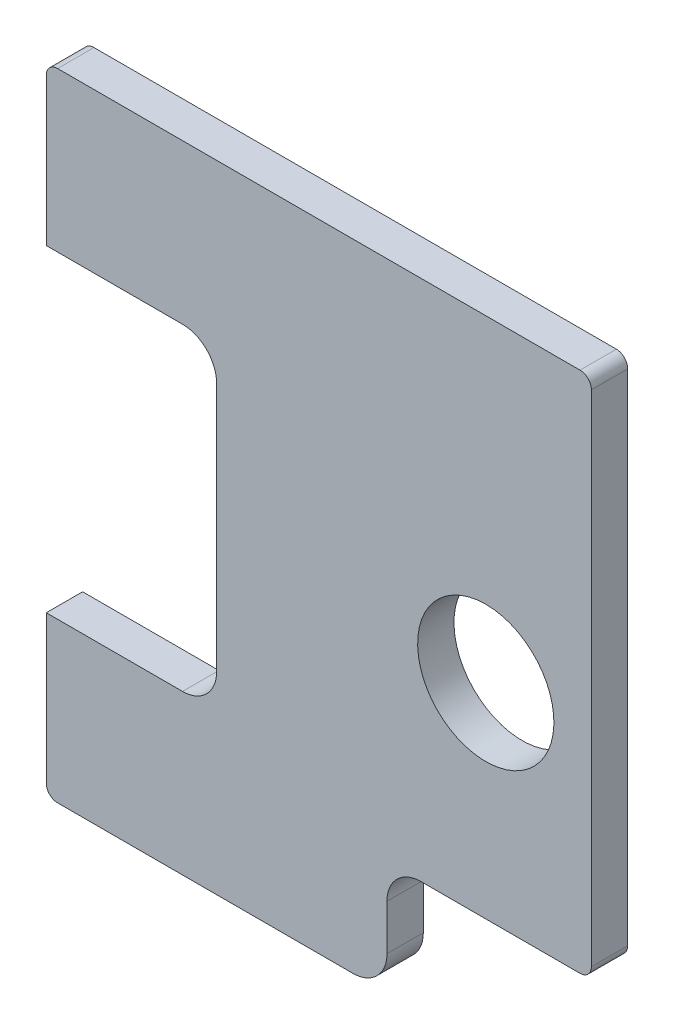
from build123d import *

# Parameters (mm, degrees)
ESQUISSE4_R          = 3
BASE_EXTRUSION_DEPTH = 1.6


with BuildPart() as part:
    # Esquisse4 → Base-Extrusion (new body)
    with BuildSketch(Plane(origin=(0, 0, -1.5), x_dir=(-1, 0, 0), z_dir=(0, 0, -1))):
        with BuildLine():
            Line((31.3, -16.254174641), (54.3, -16.254174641))
            ThreePointArc((54.3, -16.254174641), (54.653553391, -16.400621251), (54.8, -16.754174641))
            Line((54.8, -16.754174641), (54.8, -23.254174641))
            Line((54.8, -23.254174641), (48.8, -23.254174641))
            ThreePointArc((48.8, -23.254174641), (47.739339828, -23.69351447), (47.3, -24.754174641))
            Line((47.3, -24.754174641), (47.3, -35.754174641))
            ThreePointArc((47.3, -35.754174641), (47.739339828, -36.814834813), (48.8, -37.254174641))
            Line((48.8, -37.254174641), (54.8, -37.254174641))
            Line((54.8, -37.254174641), (54.8, -43.754174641))
            ThreePointArc((54.8, -43.754174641), (54.653553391, -44.107728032), (54.3, -44.254174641))
            Line((54.3, -44.254174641), (41.3, -44.254174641))
            ThreePointArc((41.3, -44.254174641), (40.239339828, -43.814834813), (39.8, -42.754174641))
            Line((39.8, -42.754174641), (39.8, -40.754174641))
            ThreePointArc((39.8, -40.754174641), (39.360660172, -39.69351447), (38.3, -39.254174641))
            Line((38.3, -39.254174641), (31.3, -39.254174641))
            ThreePointArc((31.3, -39.254174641), (30.946446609, -39.107728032), (30.8, -38.754174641))
            Line((30.8, -38.754174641), (30.8, -16.754174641))
            ThreePointArc((30.8, -16.754174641), (30.946446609, -16.400621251), (31.3, -16.254174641))
        make_face()
        with Locations(Location((35.45, -30.254174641, 0), (0, 0, 90))):
            Circle(ESQUISSE4_R, mode=Mode.SUBTRACT)
    extrude(amount=BASE_EXTRUSION_DEPTH)


solid = part.part
